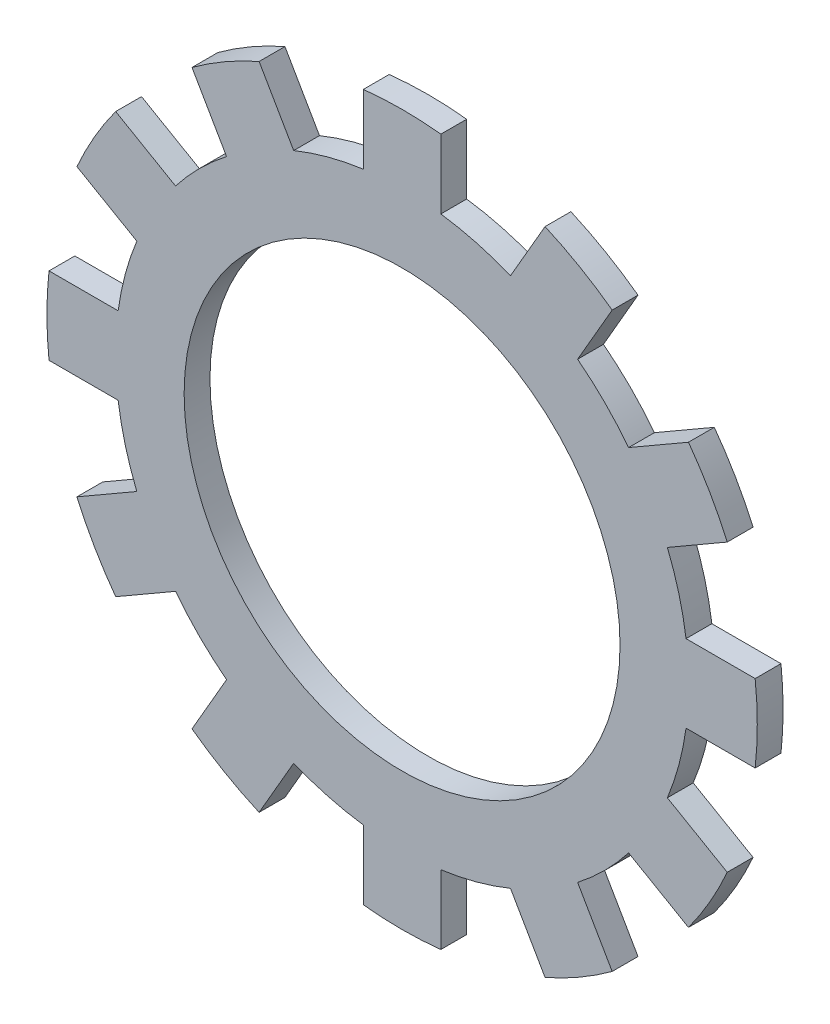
from build123d import *

# Parameters (mm, degrees)
SKETCH1_R                 = 17.75
SKETCH1_R_2               = 13.5
BOSS_EXTRUDE1_DEPTH       = 0.8
BOSS_EXTRUDE2_DEPTH       = 0.8
CIRPATTERN2_COUNT         = 12
CIRPATTERN2_COPY_1_DEPTH  = 0.8
CIRPATTERN2_COPY_2_DEPTH  = 0.8
CIRPATTERN2_COPY_3_DEPTH  = 0.8
CIRPATTERN2_COPY_4_DEPTH  = 0.8
CIRPATTERN2_COPY_5_DEPTH  = 0.8
CIRPATTERN2_COPY_6_DEPTH  = 0.8
CIRPATTERN2_COPY_7_DEPTH  = 0.8
CIRPATTERN2_COPY_8_DEPTH  = 0.8
CIRPATTERN2_COPY_9_DEPTH  = 0.8
CIRPATTERN2_COPY_10_DEPTH = 0.8
CIRPATTERN2_COPY_11_DEPTH = 0.8


with BuildPart() as part:
    # Sketch1 → Boss-Extrude1 (new, symmetric)
    with BuildSketch(Plane.XY):
        Circle(SKETCH1_R)
        Circle(SKETCH1_R_2, mode=Mode.SUBTRACT)
    extrude(amount=BOSS_EXTRUDE1_DEPTH, both=True)

    # Sketch3 → Boss-Extrude2 (add, symmetric)
    with BuildSketch(Plane.XY):
        with BuildLine():
            Line((-2.4, 21.868699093), (-2.4, 17.586998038))
            ThreePointArc((-2.4, 17.586998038), (-1.202764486, 17.709202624), (0, 17.75))
            Line((0, 17.75), (0, 22))
            ThreePointArc((0, 22), (-1.201794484, 21.967150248), (-2.4, 21.868699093))
        make_face()
    boss_extrude2 = extrude(amount=BOSS_EXTRUDE2_DEPTH, both=True)

    # Mirror1: Boss-Extrude2 across plane
    add(boss_extrude2.mirror(Plane(origin=(0, 0, 0), x_dir=(0, 0, 1), z_dir=(1, 0, 0))))

    # CirPattern2: Boss-Extrude2 ×12 about axis
    cirpattern2_axis = Axis((0, 0, 0), (0, 0, 1))
    for i in range(1, CIRPATTERN2_COUNT):
        add(boss_extrude2.rotate(cirpattern2_axis, i * 360 / CIRPATTERN2_COUNT))

    # CirPattern2 copy 1 sketch → CirPattern2 copy 1 (add, symmetric)
    with BuildSketch(Plane(origin=(0, 0, 0), x_dir=(-0.8660254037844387, -0.49999999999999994, 0), z_dir=(0, 0, 1))):
        with BuildLine():
            Line((-2.4, -21.868699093), (-2.4, -17.586998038))
            ThreePointArc((-2.4, -17.586998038), (-1.202764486, -17.709202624), (0, -17.75))
            Line((0, -17.75), (0, -22))
            ThreePointArc((0, -22), (-1.201794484, -21.967150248), (-2.4, -21.868699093))
        make_face()
    extrude(amount=CIRPATTERN2_COPY_1_DEPTH, both=True)

    # CirPattern2 copy 2 sketch → CirPattern2 copy 2 (add, symmetric)
    with BuildSketch(Plane(origin=(0, 0, 0), x_dir=(-0.5000000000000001, -0.8660254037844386, 0), z_dir=(0, 0, 1))):
        with BuildLine():
            Line((-2.4, -21.868699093), (-2.4, -17.586998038))
            ThreePointArc((-2.4, -17.586998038), (-1.202764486, -17.709202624), (0, -17.75))
            Line((0, -17.75), (0, -22))
            ThreePointArc((0, -22), (-1.201794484, -21.967150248), (-2.4, -21.868699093))
        make_face()
    extrude(amount=CIRPATTERN2_COPY_2_DEPTH, both=True)

    # CirPattern2 copy 3 sketch → CirPattern2 copy 3 (add, symmetric)
    with BuildSketch(Plane(origin=(0, 0, 0), x_dir=(0, -1, 0), z_dir=(0, 0, 1))):
        with BuildLine():
            Line((-2.4, -21.868699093), (-2.4, -17.586998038))
            ThreePointArc((-2.4, -17.586998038), (-1.202764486, -17.709202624), (0, -17.75))
            Line((0, -17.75), (0, -22))
            ThreePointArc((0, -22), (-1.201794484, -21.967150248), (-2.4, -21.868699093))
        make_face()
    extrude(amount=CIRPATTERN2_COPY_3_DEPTH, both=True)

    # CirPattern2 copy 4 sketch → CirPattern2 copy 4 (add, symmetric)
    with BuildSketch(Plane(origin=(0, 0, 0), x_dir=(0.4999999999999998, -0.8660254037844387, 0), z_dir=(0, 0, 1))):
        with BuildLine():
            Line((-2.4, -21.868699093), (-2.4, -17.586998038))
            ThreePointArc((-2.4, -17.586998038), (-1.202764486, -17.709202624), (0, -17.75))
            Line((0, -17.75), (0, -22))
            ThreePointArc((0, -22), (-1.201794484, -21.967150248), (-2.4, -21.868699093))
        make_face()
    extrude(amount=CIRPATTERN2_COPY_4_DEPTH, both=True)

    # CirPattern2 copy 5 sketch → CirPattern2 copy 5 (add, symmetric)
    with BuildSketch(Plane(origin=(0, 0, 0), x_dir=(0.8660254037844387, -0.49999999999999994, 0), z_dir=(0, 0, 1))):
        with BuildLine():
            Line((-2.4, -21.868699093), (-2.4, -17.586998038))
            ThreePointArc((-2.4, -17.586998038), (-1.202764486, -17.709202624), (0, -17.75))
            Line((0, -17.75), (0, -22))
            ThreePointArc((0, -22), (-1.201794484, -21.967150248), (-2.4, -21.868699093))
        make_face()
    extrude(amount=CIRPATTERN2_COPY_5_DEPTH, both=True)

    # CirPattern2 copy 6 sketch → CirPattern2 copy 6 (add, symmetric)
    with BuildSketch(Plane.XY):
        with BuildLine():
            Line((-2.4, -21.868699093), (-2.4, -17.586998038))
            ThreePointArc((-2.4, -17.586998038), (-1.202764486, -17.709202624), (0, -17.75))
            Line((0, -17.75), (0, -22))
            ThreePointArc((0, -22), (-1.201794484, -21.967150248), (-2.4, -21.868699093))
        make_face()
    extrude(amount=CIRPATTERN2_COPY_6_DEPTH, both=True)

    # CirPattern2 copy 7 sketch → CirPattern2 copy 7 (add, symmetric)
    with BuildSketch(Plane(origin=(0, 0, 0), x_dir=(0.8660254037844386, 0.5000000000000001, 0), z_dir=(0, 0, 1))):
        with BuildLine():
            Line((-2.4, -21.868699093), (-2.4, -17.586998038))
            ThreePointArc((-2.4, -17.586998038), (-1.202764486, -17.709202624), (0, -17.75))
            Line((0, -17.75), (0, -22))
            ThreePointArc((0, -22), (-1.201794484, -21.967150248), (-2.4, -21.868699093))
        make_face()
    extrude(amount=CIRPATTERN2_COPY_7_DEPTH, both=True)

    # CirPattern2 copy 8 sketch → CirPattern2 copy 8 (add, symmetric)
    with BuildSketch(Plane(origin=(0, 0, 0), x_dir=(0.5000000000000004, 0.8660254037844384, 0), z_dir=(0, 0, 1))):
        with BuildLine():
            Line((-2.4, -21.868699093), (-2.4, -17.586998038))
            ThreePointArc((-2.4, -17.586998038), (-1.202764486, -17.709202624), (0, -17.75))
            Line((0, -17.75), (0, -22))
            ThreePointArc((0, -22), (-1.201794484, -21.967150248), (-2.4, -21.868699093))
        make_face()
    extrude(amount=CIRPATTERN2_COPY_8_DEPTH, both=True)

    # CirPattern2 copy 9 sketch → CirPattern2 copy 9 (add, symmetric)
    with BuildSketch(Plane(origin=(0, 0, 0), x_dir=(0, 1, 0), z_dir=(0, 0, 1))):
        with BuildLine():
            Line((-2.4, -21.868699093), (-2.4, -17.586998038))
            ThreePointArc((-2.4, -17.586998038), (-1.202764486, -17.709202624), (0, -17.75))
            Line((0, -17.75), (0, -22))
            ThreePointArc((0, -22), (-1.201794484, -21.967150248), (-2.4, -21.868699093))
        make_face()
    extrude(amount=CIRPATTERN2_COPY_9_DEPTH, both=True)

    # CirPattern2 copy 10 sketch → CirPattern2 copy 10 (add, symmetric)
    with BuildSketch(Plane(origin=(0, 0, 0), x_dir=(-0.5000000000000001, 0.8660254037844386, 0), z_dir=(0, 0, 1))):
        with BuildLine():
            Line((-2.4, -21.868699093), (-2.4, -17.586998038))
            ThreePointArc((-2.4, -17.586998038), (-1.202764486, -17.709202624), (0, -17.75))
            Line((0, -17.75), (0, -22))
            ThreePointArc((0, -22), (-1.201794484, -21.967150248), (-2.4, -21.868699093))
        make_face()
    extrude(amount=CIRPATTERN2_COPY_10_DEPTH, both=True)

    # CirPattern2 copy 11 sketch → CirPattern2 copy 11 (add, symmetric)
    with BuildSketch(Plane(origin=(0, 0, 0), x_dir=(-0.8660254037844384, 0.5000000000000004, 0), z_dir=(0, 0, 1))):
        with BuildLine():
            Line((-2.4, -21.868699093), (-2.4, -17.586998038))
            ThreePointArc((-2.4, -17.586998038), (-1.202764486, -17.709202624), (0, -17.75))
            Line((0, -17.75), (0, -22))
            ThreePointArc((0, -22), (-1.201794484, -21.967150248), (-2.4, -21.868699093))
        make_face()
    extrude(amount=CIRPATTERN2_COPY_11_DEPTH, both=True)


solid = part.part
